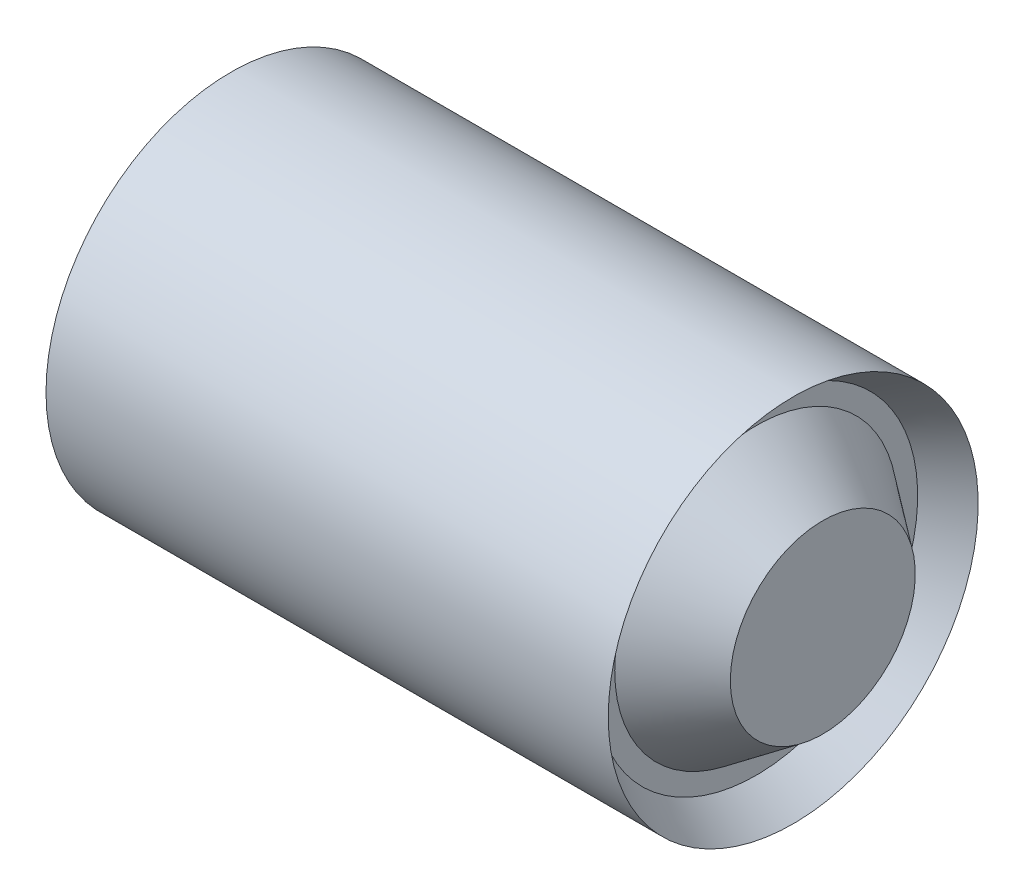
ISO-10303-21;
HEADER;
FILE_DESCRIPTION(('STEP AP214'),'2;1');
FILE_NAME('part.step','',(''),(''),'','','');
FILE_SCHEMA(('AUTOMOTIVE_DESIGN { 1 0 10303 214 1 1 1 1 }'));
ENDSEC;
DATA;
#1=APPLICATION_CONTEXT('core data for automotive mechanical design processes');
#2=APPLICATION_PROTOCOL_DEFINITION('international standard','automotive_design',2000,#1);
#3=PRODUCT_CONTEXT('',#1,'mechanical');
#4=PRODUCT('Part','Part','',(#3));
#5=PRODUCT_RELATED_PRODUCT_CATEGORY('part','',(#4));
#6=PRODUCT_DEFINITION_FORMATION('','',#4);
#7=PRODUCT_DEFINITION_CONTEXT('part definition',#1,'design');
#8=PRODUCT_DEFINITION('design','',#6,#7);
#9=PRODUCT_DEFINITION_SHAPE('','',#8);
#10=(LENGTH_UNIT() NAMED_UNIT(*) SI_UNIT(.MILLI.,.METRE.));
#11=(NAMED_UNIT(*) PLANE_ANGLE_UNIT() SI_UNIT($,.RADIAN.));
#12=(NAMED_UNIT(*) SI_UNIT($,.STERADIAN.) SOLID_ANGLE_UNIT());
#13=UNCERTAINTY_MEASURE_WITH_UNIT(LENGTH_MEASURE(1.E-05),#10,'distance_accuracy_value','');
#14=(GEOMETRIC_REPRESENTATION_CONTEXT(3) GLOBAL_UNCERTAINTY_ASSIGNED_CONTEXT((#13)) GLOBAL_UNIT_ASSIGNED_CONTEXT((#10,
#11,#12)) REPRESENTATION_CONTEXT('',''));
#15=CARTESIAN_POINT('',(0.,0.,0.));
#16=DIRECTION('',(0.,0.,1.));
#17=DIRECTION('',(1.,0.,0.));
#18=AXIS2_PLACEMENT_3D('',#15,#16,#17);
#19=CARTESIAN_POINT('',(-21.,0.,0.));
#20=DIRECTION('',(1.,0.,0.));
#21=DIRECTION('',(0.,0.,-1.));
#22=AXIS2_PLACEMENT_3D('',#19,#20,#21);
#23=PLANE('',#22);
#24=CARTESIAN_POINT('',(-21.,0.,0.));
#25=DIRECTION('',(-1.,0.,0.));
#26=DIRECTION('',(0.,0.,1.));
#27=AXIS2_PLACEMENT_3D('',#24,#25,#26);
#28=CIRCLE('',#27,6.25);
#29=CARTESIAN_POINT('',(-21.,0.,6.25));
#30=VERTEX_POINT('',#29);
#31=EDGE_CURVE('E10',#30,#30,#28,.T.);
#32=ORIENTED_EDGE('',*,*,#31,.T.);
#33=EDGE_LOOP('',(#32));
#34=FACE_BOUND('',#33,.T.);
#35=ADVANCED_FACE('F29',(#34),#23,.F.);
#36=CARTESIAN_POINT('',(-16.5,0.,0.));
#37=DIRECTION('',(1.,0.,0.));
#38=DIRECTION('',(0.,0.,-1.));
#39=AXIS2_PLACEMENT_3D('',#36,#37,#38);
#40=CONICAL_SURFACE('',#39,9.5625,0.634552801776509);
#41=ORIENTED_EDGE('',*,*,#31,.F.);
#42=EDGE_LOOP('',(#41));
#43=FACE_BOUND('',#42,.T.);
#44=CARTESIAN_POINT('',(-16.5,0.,0.));
#45=DIRECTION('',(-1.,0.,0.));
#46=DIRECTION('',(0.,0.,1.));
#47=AXIS2_PLACEMENT_3D('',#44,#45,#46);
#48=CIRCLE('',#47,9.5625);
#49=CARTESIAN_POINT('',(-16.5,0.,9.5625));
#50=VERTEX_POINT('',#49);
#51=EDGE_CURVE('E35',#50,#50,#48,.T.);
#52=ORIENTED_EDGE('',*,*,#51,.T.);
#53=EDGE_LOOP('',(#52));
#54=FACE_BOUND('',#53,.T.);
#55=ADVANCED_FACE('F73',(#43,#54),#40,.T.);
#56=CARTESIAN_POINT('',(-16.5,9.5625,0.));
#57=DIRECTION('',(1.,0.,0.));
#58=DIRECTION('',(0.,0.,-1.));
#59=AXIS2_PLACEMENT_3D('',#56,#57,#58);
#60=PLANE('',#59);
#61=ORIENTED_EDGE('',*,*,#51,.F.);
#62=EDGE_LOOP('',(#61));
#63=FACE_BOUND('',#62,.T.);
#64=CARTESIAN_POINT('',(-16.5,0.,0.));
#65=DIRECTION('',(-1.,0.,0.));
#66=DIRECTION('',(0.,0.,1.));
#67=AXIS2_PLACEMENT_3D('',#64,#65,#66);
#68=CIRCLE('',#67,10.9110169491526);
#69=CARTESIAN_POINT('',(-16.5,0.,10.9110169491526));
#70=VERTEX_POINT('',#69);
#71=EDGE_CURVE('E39',#70,#70,#68,.T.);
#72=ORIENTED_EDGE('',*,*,#71,.T.);
#73=EDGE_LOOP('',(#72));
#74=FACE_BOUND('',#73,.T.);
#75=ADVANCED_FACE('F77',(#63,#74),#60,.F.);
#76=CARTESIAN_POINT('',(-19.,0.,0.));
#77=DIRECTION('',(-1.,0.,0.));
#78=DIRECTION('',(0.,0.,1.));
#79=AXIS2_PLACEMENT_3D('',#76,#77,#78);
#80=CONICAL_SURFACE('',#79,12.5,0.566180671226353);
#81=ORIENTED_EDGE('',*,*,#71,.F.);
#82=EDGE_LOOP('',(#81));
#83=FACE_BOUND('',#82,.T.);
#84=CARTESIAN_POINT('',(-19.,0.,0.));
#85=DIRECTION('',(-1.,0.,0.));
#86=DIRECTION('',(0.,0.,1.));
#87=AXIS2_PLACEMENT_3D('',#84,#85,#86);
#88=CIRCLE('',#87,12.5);
#89=CARTESIAN_POINT('',(-19.,0.,12.5));
#90=VERTEX_POINT('',#89);
#91=EDGE_CURVE('E43',#90,#90,#88,.T.);
#92=ORIENTED_EDGE('',*,*,#91,.T.);
#93=EDGE_LOOP('',(#92));
#94=FACE_BOUND('',#93,.T.);
#95=ADVANCED_FACE('F82',(#83,#94),#80,.F.);
#96=CARTESIAN_POINT('',(21.,0.,0.));
#97=DIRECTION('',(-1.,0.,0.));
#98=DIRECTION('',(0.,0.,1.));
#99=AXIS2_PLACEMENT_3D('',#96,#97,#98);
#100=CYLINDRICAL_SURFACE('',#99,12.5);
#101=ORIENTED_EDGE('',*,*,#91,.F.);
#102=EDGE_LOOP('',(#101));
#103=FACE_BOUND('',#102,.T.);
#104=CARTESIAN_POINT('',(19.,0.,0.));
#105=DIRECTION('',(-1.,0.,0.));
#106=DIRECTION('',(0.,0.,1.));
#107=AXIS2_PLACEMENT_3D('',#104,#105,#106);
#108=CIRCLE('',#107,12.5);
#109=CARTESIAN_POINT('',(19.,0.,12.5));
#110=VERTEX_POINT('',#109);
#111=EDGE_CURVE('E48',#110,#110,#108,.T.);
#112=ORIENTED_EDGE('',*,*,#111,.T.);
#113=EDGE_LOOP('',(#112));
#114=FACE_BOUND('',#113,.T.);
#115=ADVANCED_FACE('F88',(#103,#114),#100,.T.);
#116=CARTESIAN_POINT('',(16.5,0.,0.));
#117=DIRECTION('',(1.,0.,0.));
#118=DIRECTION('',(0.,0.,-1.));
#119=AXIS2_PLACEMENT_3D('',#116,#117,#118);
#120=CONICAL_SURFACE('',#119,10.9110169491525,0.566180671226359);
#121=ORIENTED_EDGE('',*,*,#111,.F.);
#122=EDGE_LOOP('',(#121));
#123=FACE_BOUND('',#122,.T.);
#124=CARTESIAN_POINT('',(16.5,0.,0.));
#125=DIRECTION('',(-1.,0.,0.));
#126=DIRECTION('',(0.,0.,1.));
#127=AXIS2_PLACEMENT_3D('',#124,#125,#126);
#128=CIRCLE('',#127,10.9110169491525);
#129=CARTESIAN_POINT('',(16.5,0.,10.9110169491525));
#130=VERTEX_POINT('',#129);
#131=EDGE_CURVE('E51',#130,#130,#128,.T.);
#132=ORIENTED_EDGE('',*,*,#131,.T.);
#133=EDGE_LOOP('',(#132));
#134=FACE_BOUND('',#133,.T.);
#135=ADVANCED_FACE('F92',(#123,#134),#120,.F.);
#136=CARTESIAN_POINT('',(16.5,10.9110169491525,0.));
#137=DIRECTION('',(-1.,0.,0.));
#138=DIRECTION('',(0.,0.,1.));
#139=AXIS2_PLACEMENT_3D('',#136,#137,#138);
#140=PLANE('',#139);
#141=ORIENTED_EDGE('',*,*,#131,.F.);
#142=EDGE_LOOP('',(#141));
#143=FACE_BOUND('',#142,.T.);
#144=CARTESIAN_POINT('',(16.5,0.,0.));
#145=DIRECTION('',(-1.,0.,0.));
#146=DIRECTION('',(0.,0.,1.));
#147=AXIS2_PLACEMENT_3D('',#144,#145,#146);
#148=CIRCLE('',#147,9.56249999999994);
#149=CARTESIAN_POINT('',(16.5,0.,9.56249999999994));
#150=VERTEX_POINT('',#149);
#151=EDGE_CURVE('E54',#150,#150,#148,.T.);
#152=ORIENTED_EDGE('',*,*,#151,.T.);
#153=EDGE_LOOP('',(#152));
#154=FACE_BOUND('',#153,.T.);
#155=ADVANCED_FACE('F69',(#143,#154),#140,.F.);
#156=CARTESIAN_POINT('',(21.,0.,0.));
#157=DIRECTION('',(-1.,0.,0.));
#158=DIRECTION('',(0.,0.,1.));
#159=AXIS2_PLACEMENT_3D('',#156,#157,#158);
#160=CONICAL_SURFACE('',#159,6.25,0.6345528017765);
#161=ORIENTED_EDGE('',*,*,#151,.F.);
#162=EDGE_LOOP('',(#161));
#163=FACE_BOUND('',#162,.T.);
#164=CARTESIAN_POINT('',(21.,0.,0.));
#165=DIRECTION('',(-1.,0.,0.));
#166=DIRECTION('',(0.,0.,1.));
#167=AXIS2_PLACEMENT_3D('',#164,#165,#166);
#168=CIRCLE('',#167,6.25);
#169=CARTESIAN_POINT('',(21.,0.,6.25));
#170=VERTEX_POINT('',#169);
#171=EDGE_CURVE('E57',#170,#170,#168,.T.);
#172=ORIENTED_EDGE('',*,*,#171,.T.);
#173=EDGE_LOOP('',(#172));
#174=FACE_BOUND('',#173,.T.);
#175=ADVANCED_FACE('F61',(#163,#174),#160,.T.);
#176=CARTESIAN_POINT('',(21.,6.25,0.));
#177=DIRECTION('',(-1.,0.,0.));
#178=DIRECTION('',(0.,0.,1.));
#179=AXIS2_PLACEMENT_3D('',#176,#177,#178);
#180=PLANE('',#179);
#181=ORIENTED_EDGE('',*,*,#171,.F.);
#182=EDGE_LOOP('',(#181));
#183=FACE_BOUND('',#182,.T.);
#184=ADVANCED_FACE('F63',(#183),#180,.F.);
#185=CLOSED_SHELL('',(#35,#55,#75,#95,#115,#135,#155,#175,#184));
#186=MANIFOLD_SOLID_BREP('B2',#185);
#187=ADVANCED_BREP_SHAPE_REPRESENTATION('',(#18,#186),#14);
#188=SHAPE_DEFINITION_REPRESENTATION(#9,#187);
ENDSEC;
END-ISO-10303-21;
